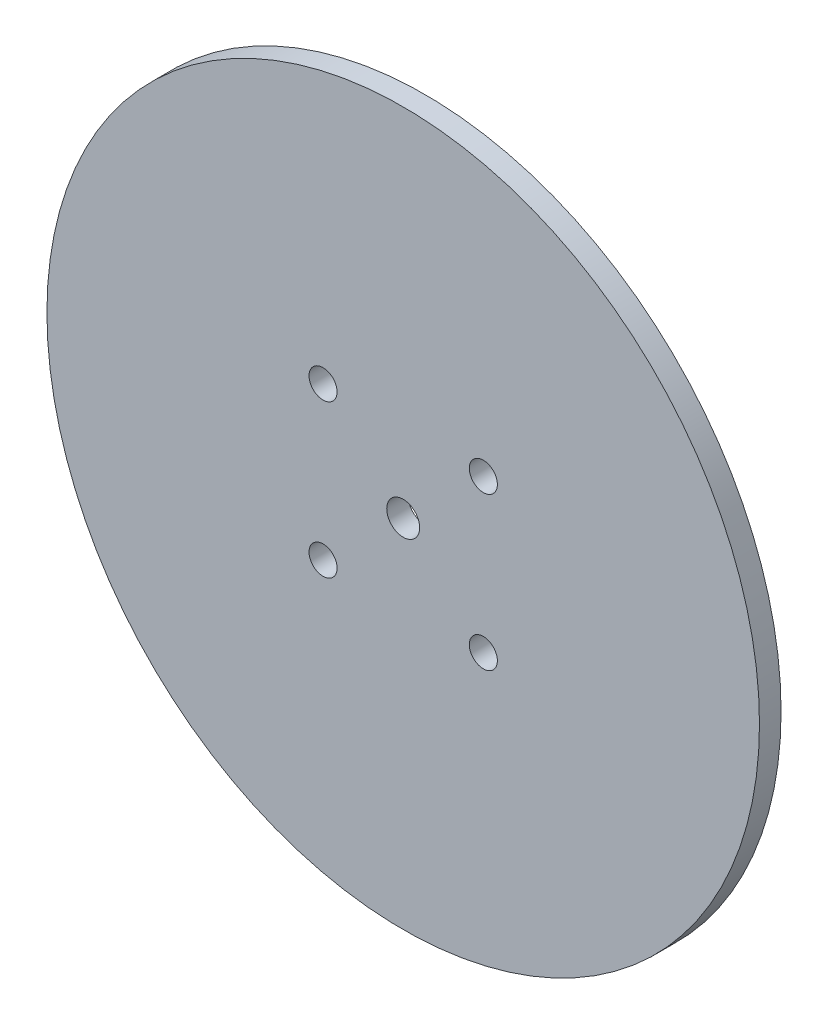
from build123d import *

# Parameters (mm, degrees)
SKETCH_1_R          = 66
EXTRUDE_3_DEPTH     = 4
SKETCH_15_R         = 2.6
CUT_EXTRUDE_1_DEPTH = 94.423765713
SKETCH_17_R         = 3.05
CUT_EXTRUDE_2_DEPTH = 94.423765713


with BuildPart() as part:
    # Sketch 1 → Extrude 3 (new body)
    with BuildSketch(Plane.XY):
        Circle(SKETCH_1_R)
    extrude(amount=EXTRUDE_3_DEPTH)

    # Sketch 15 → Cut-Extrude 1 (cut, through all)
    with BuildSketch(Plane(origin=(0, 0, 0), x_dir=(-1, 0, 0), z_dir=(0, 0, -1))):
        with Locations((-14.845865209, 14.13684145)):
            Circle(SKETCH_15_R)
        with Locations((14.845865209, 14.13684145)):
            Circle(SKETCH_15_R)
        with Locations((14.845865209, -14.13684145)):
            Circle(SKETCH_15_R)
        with Locations((-14.845865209, -14.13684145)):
            Circle(SKETCH_15_R)
    extrude(amount=-CUT_EXTRUDE_1_DEPTH, mode=Mode.SUBTRACT)

    # Sketch 17 → Cut-Extrude 2 (cut, through all)
    with BuildSketch(Plane(origin=(0, 0, 0), x_dir=(-1, 0, 0), z_dir=(0, 0, -1))):
        Circle(SKETCH_17_R)
    extrude(amount=-CUT_EXTRUDE_2_DEPTH, mode=Mode.SUBTRACT)


solid = part.part
